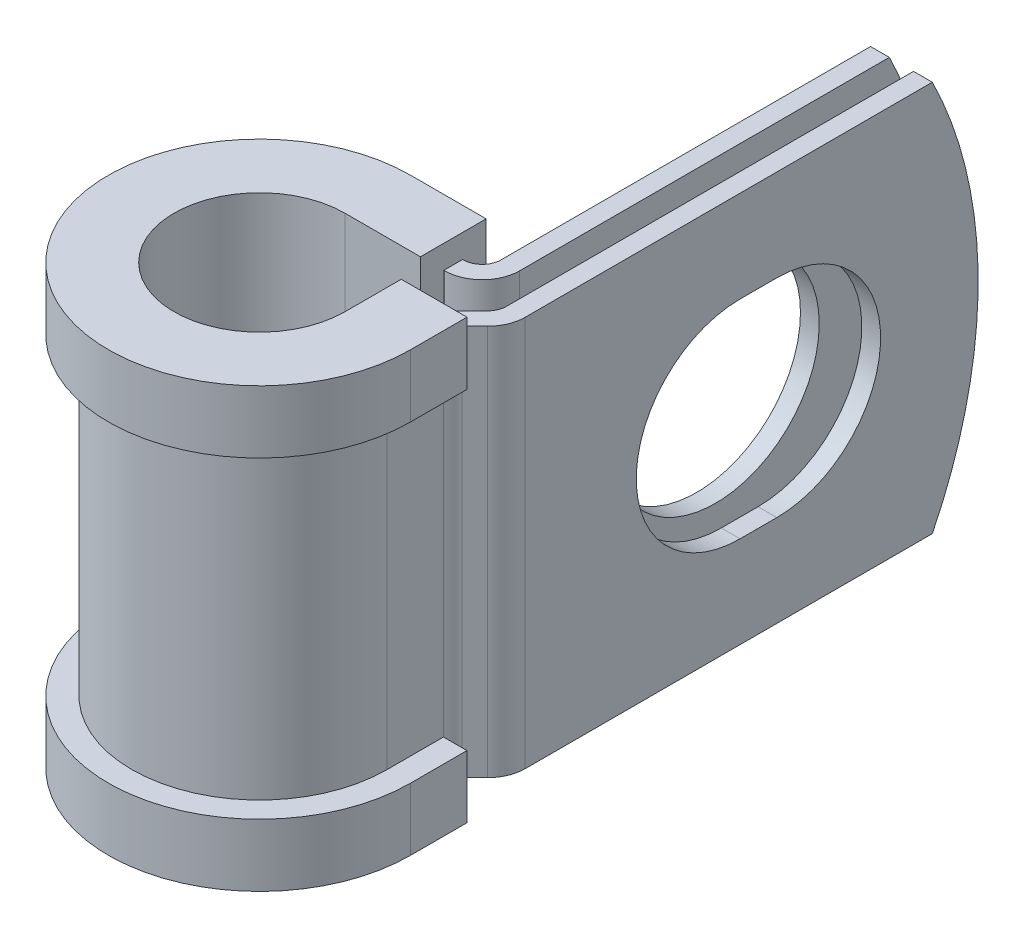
from build123d import *

# Parameters (mm, degrees)
EXTRUDE_THIN1_DEPTH = 12.7
SKETCH2_R           = 6.7437
CUT_EXTRUDE1_DEPTH  = 1.2192
CUT_EXTRUDE2_DEPTH  = 1.2192
CUT_EXTRUDE3_DEPTH  = 42.266450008


with BuildPart() as part:
    # Sketch1 → Extrude-Thin1 (new, symmetric)
    with BuildSketch(Plane(origin=(0, 0, 0), x_dir=(1, 0, 0), z_dir=(0, 1, 0))):
        with BuildLine():
            Line((8.9713698, 36.4998), (8.9713698, 7.0739))
            ThreePointArc((8.9713698, 7.0739), (8.878563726, 6.607332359), (8.614274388, 6.211795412))
            Line((8.614274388, 6.211795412), (7.788090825, 5.385611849))
            ThreePointArc((7.788090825, 5.385611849), (7.259512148, 4.594537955), (7.0739, 3.661402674))
            Line((7.0739, 3.661402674), (7.0739, 0))
            ThreePointArc((7.0739, 0), (-5.002002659, -5.002002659), (0, 7.0739))
            Line((0, 7.0739), (4.9581698, 7.0739))
            ThreePointArc((4.9581698, 7.0739), (6.682378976, 7.788090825), (7.3965698, 9.5123))
            Line((7.3965698, 9.5123), (7.3965698, 36.4998))
            Line((7.3965698, 36.4998), (6.1773698, 36.4998))
            Line((6.1773698, 36.4998), (6.1773698, 9.5123))
            ThreePointArc((6.1773698, 9.5123), (5.820274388, 8.650195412), (4.9581698, 8.2931))
            Line((4.9581698, 8.2931), (0, 8.2931))
            ThreePointArc((0, 8.2931), (-5.864107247, -5.864107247), (8.2931, 0))
            Line((8.2931, 0), (8.2931, 3.661402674))
            ThreePointArc((8.2931, 3.661402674), (8.385906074, 4.127970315), (8.650195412, 4.523507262))
            Line((8.650195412, 4.523507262), (9.476378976, 5.349690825))
            ThreePointArc((9.476378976, 5.349690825), (10.004957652, 6.140764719), (10.1905698, 7.0739))
            Line((10.1905698, 7.0739), (10.1905698, 36.4998))
            Line((10.1905698, 36.4998), (8.9713698, 36.4998))
        make_face()
    extrude(amount=EXTRUDE_THIN1_DEPTH, both=True)

    # Sketch2 → Cut-Extrude1 (cut)
    with BuildSketch(Plane.ZY.offset(-6.1773698)):
        with Locations((-22.225, 0)):
            Circle(SKETCH2_R)
    extrude(amount=-CUT_EXTRUDE1_DEPTH, mode=Mode.SUBTRACT)

    # Sketch3 → Cut-Extrude2 (cut)
    with BuildSketch(Plane(origin=(10.1905698, 0, 0), x_dir=(0, 0, -1), z_dir=(1, 0, 0))):
        with BuildLine():
            Line((21.0312, 6.7437), (23.4188, 6.7437))
            ThreePointArc((23.4188, 6.7437), (30.1625, 0), (23.4188, -6.7437))
            Line((23.4188, -6.7437), (21.0312, -6.7437))
            ThreePointArc((21.0312, -6.7437), (14.2875, 0), (21.0312, 6.7437))
        make_face()
    extrude(amount=-CUT_EXTRUDE2_DEPTH, mode=Mode.SUBTRACT)

    # Sketch4 → Cut-Extrude3 (cut, through all)
    with BuildSketch(Plane.ZY.offset(-6.1773698)):
        with BuildLine():
            Line((-33.522468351, 12.7), (-36.4998, 12.7))
            Line((-36.4998, 12.7), (-36.4998, 0))
            ThreePointArc((-36.4998, 0), (-35.745511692, 6.522164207), (-33.522468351, 12.7))
        make_face()
        with BuildLine():
            ThreePointArc((-33.522468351, -12.7), (-35.745511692, -6.522164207), (-36.4998, 0))
            Line((-36.4998, 0), (-36.4998, -12.7))
            Line((-36.4998, -12.7), (-33.522468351, -12.7))
        make_face()
    extrude(amount=-CUT_EXTRUDE3_DEPTH, mode=Mode.SUBTRACT)

    # Sweep1: sweep along a path in Sketch6
    with BuildLine(Plane(origin=(0, 12.7, 0), x_dir=(1, 0, 0), z_dir=(0, 1, 0))) as sweep1_path:
        Line((5.5499, 3.661402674), (5.5499, 0))
        ThreePointArc((5.5499, 0), (-3.924371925, -3.924371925), (0, 5.5499))
        Line((0, 5.5499), (4.9073698, 5.5499))
    # Sketch5 → Sweep1 (sweep)
    with BuildSketch(Plane(origin=(0, 0, -3.661402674), x_dir=(-1, 0, 0), z_dir=(0, 0, -1))):
        Polygon((-8.2931, 12.7), (-7.0739, 12.7), (-7.0739, -12.7), (-8.2931, -12.7), (-8.2931, -10.16), (-9.8171, -10.16), (-9.8171, -14.224), (-5.5499, -14.224), (-5.5499, 14.224), (-9.8171, 14.224), (-9.8171, 10.16), (-8.2931, 10.16), align=None)
    sweep(path=sweep1_path.line)


solid = part.part
